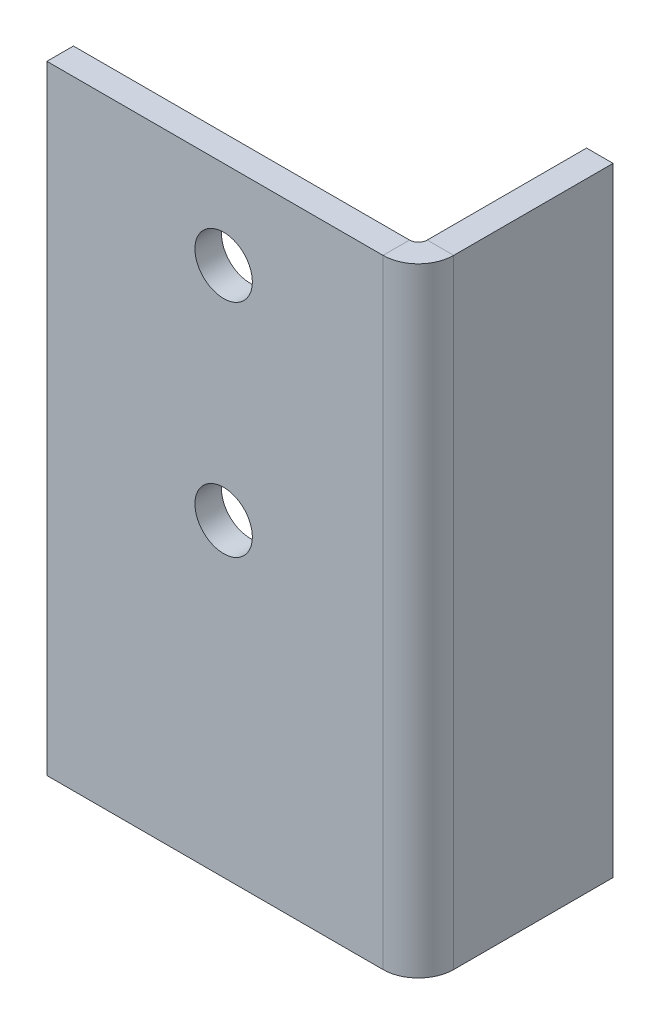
ISO-10303-21;
HEADER;
FILE_DESCRIPTION(('STEP AP214'),'2;1');
FILE_NAME('part.step','',(''),(''),'','','');
FILE_SCHEMA(('AUTOMOTIVE_DESIGN { 1 0 10303 214 1 1 1 1 }'));
ENDSEC;
DATA;
#1=APPLICATION_CONTEXT('core data for automotive mechanical design processes');
#2=APPLICATION_PROTOCOL_DEFINITION('international standard','automotive_design',2000,#1);
#3=PRODUCT_CONTEXT('',#1,'mechanical');
#4=PRODUCT('Part','Part','',(#3));
#5=PRODUCT_RELATED_PRODUCT_CATEGORY('part','',(#4));
#6=PRODUCT_DEFINITION_FORMATION('','',#4);
#7=PRODUCT_DEFINITION_CONTEXT('part definition',#1,'design');
#8=PRODUCT_DEFINITION('design','',#6,#7);
#9=PRODUCT_DEFINITION_SHAPE('','',#8);
#10=(LENGTH_UNIT() NAMED_UNIT(*) SI_UNIT(.MILLI.,.METRE.));
#11=(NAMED_UNIT(*) PLANE_ANGLE_UNIT() SI_UNIT($,.RADIAN.));
#12=(NAMED_UNIT(*) SI_UNIT($,.STERADIAN.) SOLID_ANGLE_UNIT());
#13=UNCERTAINTY_MEASURE_WITH_UNIT(LENGTH_MEASURE(1.E-05),#10,'distance_accuracy_value','');
#14=(GEOMETRIC_REPRESENTATION_CONTEXT(3) GLOBAL_UNCERTAINTY_ASSIGNED_CONTEXT((#13)) GLOBAL_UNIT_ASSIGNED_CONTEXT((#10,
#11,#12)) REPRESENTATION_CONTEXT('',''));
#15=CARTESIAN_POINT('',(0.,0.,0.));
#16=DIRECTION('',(0.,0.,1.));
#17=DIRECTION('',(1.,0.,0.));
#18=AXIS2_PLACEMENT_3D('',#15,#16,#17);
#19=CARTESIAN_POINT('',(-35.926990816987,140.,81.9269908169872));
#20=DIRECTION('',(0.,-1.,0.));
#21=DIRECTION('',(-1.,0.,0.));
#22=AXIS2_PLACEMENT_3D('',#19,#20,#21);
#23=PLANE('',#22);
#24=DIRECTION('',(0.,0.,1.));
#25=VECTOR('',#24,1.);
#26=CARTESIAN_POINT('',(-41.926990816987,140.,81.9269908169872));
#27=LINE('',#26,#25);
#28=CARTESIAN_POINT('',(-41.9269908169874,140.,-38.0730091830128));
#29=VERTEX_POINT('',#28);
#30=CARTESIAN_POINT('',(-41.9269908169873,140.,-2.00000000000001));
#31=VERTEX_POINT('',#30);
#32=EDGE_CURVE('E93',#29,#31,#27,.T.);
#33=ORIENTED_EDGE('',*,*,#32,.T.);
#34=DIRECTION('',(1.,0.,0.));
#35=VECTOR('',#34,1.);
#36=CARTESIAN_POINT('',(-35.9269908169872,140.,-2.00000000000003));
#37=LINE('',#36,#35);
#38=CARTESIAN_POINT('',(-35.9269908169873,140.,-2.00000000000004));
#39=VERTEX_POINT('',#38);
#40=EDGE_CURVE('E108',#31,#39,#37,.T.);
#41=ORIENTED_EDGE('',*,*,#40,.T.);
#42=DIRECTION('',(0.,0.,1.));
#43=VECTOR('',#42,1.);
#44=CARTESIAN_POINT('',(-35.926990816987,140.,81.9269908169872));
#45=LINE('',#44,#43);
#46=CARTESIAN_POINT('',(-35.9269908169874,140.,-38.0730091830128));
#47=VERTEX_POINT('',#46);
#48=EDGE_CURVE('E49',#47,#39,#45,.T.);
#49=ORIENTED_EDGE('',*,*,#48,.F.);
#50=DIRECTION('',(-1.,0.,0.));
#51=VECTOR('',#50,1.);
#52=CARTESIAN_POINT('',(-35.9269908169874,140.,-38.0730091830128));
#53=LINE('',#52,#51);
#54=EDGE_CURVE('E86',#47,#29,#53,.T.);
#55=ORIENTED_EDGE('',*,*,#54,.T.);
#56=EDGE_LOOP('',(#33,#41,#49,#55));
#57=FACE_BOUND('',#56,.T.);
#58=ADVANCED_FACE('F45',(#57),#23,.F.);
#59=CARTESIAN_POINT('',(-35.926990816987,0.,81.9269908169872));
#60=DIRECTION('',(0.,1.,0.));
#61=DIRECTION('',(1.,0.,0.));
#62=AXIS2_PLACEMENT_3D('',#59,#60,#61);
#63=PLANE('',#62);
#64=DIRECTION('',(0.,0.,-1.));
#65=VECTOR('',#64,1.);
#66=CARTESIAN_POINT('',(-35.926990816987,0.,81.9269908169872));
#67=LINE('',#66,#65);
#68=CARTESIAN_POINT('',(-35.9269908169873,0.,-2.00000000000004));
#69=VERTEX_POINT('',#68);
#70=CARTESIAN_POINT('',(-35.9269908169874,0.,-38.0730091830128));
#71=VERTEX_POINT('',#70);
#72=EDGE_CURVE('E102',#69,#71,#67,.T.);
#73=ORIENTED_EDGE('',*,*,#72,.F.);
#74=DIRECTION('',(-1.,0.,0.));
#75=VECTOR('',#74,1.);
#76=CARTESIAN_POINT('',(-35.9269908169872,0.,-2.00000000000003));
#77=LINE('',#76,#75);
#78=CARTESIAN_POINT('',(-41.9269908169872,0.,-2.00000000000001));
#79=VERTEX_POINT('',#78);
#80=EDGE_CURVE('E12',#69,#79,#77,.T.);
#81=ORIENTED_EDGE('',*,*,#80,.T.);
#82=DIRECTION('',(0.,0.,-1.));
#83=VECTOR('',#82,1.);
#84=CARTESIAN_POINT('',(-41.926990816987,0.,81.9269908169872));
#85=LINE('',#84,#83);
#86=CARTESIAN_POINT('',(-41.9269908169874,0.,-38.0730091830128));
#87=VERTEX_POINT('',#86);
#88=EDGE_CURVE('E94',#79,#87,#85,.T.);
#89=ORIENTED_EDGE('',*,*,#88,.T.);
#90=DIRECTION('',(-1.,0.,0.));
#91=VECTOR('',#90,1.);
#92=CARTESIAN_POINT('',(-35.9269908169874,0.,-38.0730091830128));
#93=LINE('',#92,#91);
#94=EDGE_CURVE('E89',#71,#87,#93,.T.);
#95=ORIENTED_EDGE('',*,*,#94,.F.);
#96=EDGE_LOOP('',(#73,#81,#89,#95));
#97=FACE_BOUND('',#96,.T.);
#98=ADVANCED_FACE('F47',(#97),#63,.F.);
#99=CARTESIAN_POINT('',(-35.926990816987,140.,81.9269908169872));
#100=DIRECTION('',(-1.,0.,0.));
#101=DIRECTION('',(0.,0.,1.));
#102=AXIS2_PLACEMENT_3D('',#99,#100,#101);
#103=PLANE('',#102);
#104=ORIENTED_EDGE('',*,*,#48,.T.);
#105=DIRECTION('',(0.,-1.,0.));
#106=VECTOR('',#105,1.);
#107=CARTESIAN_POINT('',(-35.9269908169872,140.,-2.00000000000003));
#108=LINE('',#107,#106);
#109=EDGE_CURVE('E110',#39,#69,#108,.T.);
#110=ORIENTED_EDGE('',*,*,#109,.T.);
#111=ORIENTED_EDGE('',*,*,#72,.T.);
#112=DIRECTION('',(0.,1.,0.));
#113=VECTOR('',#112,1.);
#114=CARTESIAN_POINT('',(-35.9269908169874,0.,-38.0730091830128));
#115=LINE('',#114,#113);
#116=EDGE_CURVE('E70',#71,#47,#115,.T.);
#117=ORIENTED_EDGE('',*,*,#116,.T.);
#118=EDGE_LOOP('',(#104,#110,#111,#117));
#119=FACE_BOUND('',#118,.T.);
#120=ADVANCED_FACE('F242',(#119),#103,.F.);
#121=CARTESIAN_POINT('',(-41.926990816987,140.,81.9269908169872));
#122=DIRECTION('',(-1.,0.,0.));
#123=DIRECTION('',(0.,0.,1.));
#124=AXIS2_PLACEMENT_3D('',#121,#122,#123);
#125=PLANE('',#124);
#126=DIRECTION('',(0.,-1.,0.));
#127=VECTOR('',#126,1.);
#128=CARTESIAN_POINT('',(-41.9269908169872,140.,-2.00000000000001));
#129=LINE('',#128,#127);
#130=EDGE_CURVE('E54',#31,#79,#129,.T.);
#131=ORIENTED_EDGE('',*,*,#130,.F.);
#132=ORIENTED_EDGE('',*,*,#32,.F.);
#133=DIRECTION('',(0.,1.,0.));
#134=VECTOR('',#133,1.);
#135=CARTESIAN_POINT('',(-41.9269908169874,0.,-38.0730091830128));
#136=LINE('',#135,#134);
#137=EDGE_CURVE('E83',#87,#29,#136,.T.);
#138=ORIENTED_EDGE('',*,*,#137,.F.);
#139=ORIENTED_EDGE('',*,*,#88,.F.);
#140=EDGE_LOOP('',(#131,#132,#138,#139));
#141=FACE_BOUND('',#140,.T.);
#142=ADVANCED_FACE('F101',(#141),#125,.T.);
#143=CARTESIAN_POINT('',(-35.9269908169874,0.,-38.0730091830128));
#144=DIRECTION('',(0.,0.,1.));
#145=DIRECTION('',(1.,0.,0.));
#146=AXIS2_PLACEMENT_3D('',#143,#144,#145);
#147=PLANE('',#146);
#148=ORIENTED_EDGE('',*,*,#137,.T.);
#149=ORIENTED_EDGE('',*,*,#54,.F.);
#150=ORIENTED_EDGE('',*,*,#116,.F.);
#151=ORIENTED_EDGE('',*,*,#94,.T.);
#152=EDGE_LOOP('',(#148,#149,#150,#151));
#153=FACE_BOUND('',#152,.T.);
#154=ADVANCED_FACE('F85',(#153),#147,.F.);
#155=CARTESIAN_POINT('',(-80.,120.,6.));
#156=DIRECTION('',(0.,0.,-1.));
#157=DIRECTION('',(-1.,0.,0.));
#158=AXIS2_PLACEMENT_3D('',#155,#156,#157);
#159=CYLINDRICAL_SURFACE('',#158,6.5);
#160=CARTESIAN_POINT('',(-80.,120.,6.));
#161=DIRECTION('',(0.,0.,1.));
#162=DIRECTION('',(1.,0.,0.));
#163=AXIS2_PLACEMENT_3D('',#160,#161,#162);
#164=CIRCLE('',#163,6.5);
#165=CARTESIAN_POINT('',(-73.5,120.,6.));
#166=VERTEX_POINT('',#165);
#167=EDGE_CURVE('E125',#166,#166,#164,.T.);
#168=ORIENTED_EDGE('',*,*,#167,.T.);
#169=EDGE_LOOP('',(#168));
#170=FACE_BOUND('',#169,.T.);
#171=CARTESIAN_POINT('',(-80.,120.,0.));
#172=DIRECTION('',(0.,0.,1.));
#173=DIRECTION('',(1.,0.,0.));
#174=AXIS2_PLACEMENT_3D('',#171,#172,#173);
#175=CIRCLE('',#174,6.5);
#176=CARTESIAN_POINT('',(-73.5,120.,0.));
#177=VERTEX_POINT('',#176);
#178=EDGE_CURVE('E152',#177,#177,#175,.T.);
#179=ORIENTED_EDGE('',*,*,#178,.F.);
#180=EDGE_LOOP('',(#179));
#181=FACE_BOUND('',#180,.T.);
#182=ADVANCED_FACE('F234',(#170,#181),#159,.F.);
#183=CARTESIAN_POINT('',(-80.,70.,6.));
#184=DIRECTION('',(0.,0.,-1.));
#185=DIRECTION('',(-1.,0.,0.));
#186=AXIS2_PLACEMENT_3D('',#183,#184,#185);
#187=CYLINDRICAL_SURFACE('',#186,6.5);
#188=CARTESIAN_POINT('',(-80.,70.,6.));
#189=DIRECTION('',(0.,0.,1.));
#190=DIRECTION('',(1.,0.,0.));
#191=AXIS2_PLACEMENT_3D('',#188,#189,#190);
#192=CIRCLE('',#191,6.5);
#193=CARTESIAN_POINT('',(-73.5,70.,6.));
#194=VERTEX_POINT('',#193);
#195=EDGE_CURVE('E128',#194,#194,#192,.T.);
#196=ORIENTED_EDGE('',*,*,#195,.T.);
#197=EDGE_LOOP('',(#196));
#198=FACE_BOUND('',#197,.T.);
#199=CARTESIAN_POINT('',(-80.,70.,0.));
#200=DIRECTION('',(0.,0.,1.));
#201=DIRECTION('',(1.,0.,0.));
#202=AXIS2_PLACEMENT_3D('',#199,#200,#201);
#203=CIRCLE('',#202,6.5);
#204=CARTESIAN_POINT('',(-73.5,70.,0.));
#205=VERTEX_POINT('',#204);
#206=EDGE_CURVE('E149',#205,#205,#203,.T.);
#207=ORIENTED_EDGE('',*,*,#206,.F.);
#208=EDGE_LOOP('',(#207));
#209=FACE_BOUND('',#208,.T.);
#210=ADVANCED_FACE('F227',(#198,#209),#187,.F.);
#211=CARTESIAN_POINT('',(-120.,0.,6.));
#212=DIRECTION('',(1.,0.,0.));
#213=DIRECTION('',(0.,0.,-1.));
#214=AXIS2_PLACEMENT_3D('',#211,#212,#213);
#215=PLANE('',#214);
#216=DIRECTION('',(0.,-1.,0.));
#217=VECTOR('',#216,1.);
#218=CARTESIAN_POINT('',(-120.,0.,0.));
#219=LINE('',#218,#217);
#220=CARTESIAN_POINT('',(-120.,140.,0.));
#221=VERTEX_POINT('',#220);
#222=CARTESIAN_POINT('',(-120.,0.,0.));
#223=VERTEX_POINT('',#222);
#224=EDGE_CURVE('E131',#221,#223,#219,.T.);
#225=ORIENTED_EDGE('',*,*,#224,.T.);
#226=DIRECTION('',(0.,0.,-1.));
#227=VECTOR('',#226,1.);
#228=CARTESIAN_POINT('',(-120.,0.,6.));
#229=LINE('',#228,#227);
#230=CARTESIAN_POINT('',(-120.,0.,6.));
#231=VERTEX_POINT('',#230);
#232=EDGE_CURVE('E158',#231,#223,#229,.T.);
#233=ORIENTED_EDGE('',*,*,#232,.F.);
#234=DIRECTION('',(0.,-1.,0.));
#235=VECTOR('',#234,1.);
#236=CARTESIAN_POINT('',(-120.,0.,6.));
#237=LINE('',#236,#235);
#238=CARTESIAN_POINT('',(-120.,140.,6.));
#239=VERTEX_POINT('',#238);
#240=EDGE_CURVE('E140',#239,#231,#237,.T.);
#241=ORIENTED_EDGE('',*,*,#240,.F.);
#242=DIRECTION('',(0.,0.,-1.));
#243=VECTOR('',#242,1.);
#244=CARTESIAN_POINT('',(-120.,140.,6.));
#245=LINE('',#244,#243);
#246=EDGE_CURVE('E134',#239,#221,#245,.T.);
#247=ORIENTED_EDGE('',*,*,#246,.T.);
#248=EDGE_LOOP('',(#225,#233,#241,#247));
#249=FACE_BOUND('',#248,.T.);
#250=ADVANCED_FACE('F225',(#249),#215,.F.);
#251=CARTESIAN_POINT('',(-120.,140.,6.));
#252=DIRECTION('',(0.,0.,-1.));
#253=DIRECTION('',(-1.,0.,0.));
#254=AXIS2_PLACEMENT_3D('',#251,#252,#253);
#255=PLANE('',#254);
#256=DIRECTION('',(0.,-1.,0.));
#257=VECTOR('',#256,1.);
#258=CARTESIAN_POINT('',(-43.9269908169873,140.,6.));
#259=LINE('',#258,#257);
#260=CARTESIAN_POINT('',(-43.9269908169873,140.,6.));
#261=VERTEX_POINT('',#260);
#262=CARTESIAN_POINT('',(-43.9269908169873,0.,6.));
#263=VERTEX_POINT('',#262);
#264=EDGE_CURVE('E115',#261,#263,#259,.T.);
#265=ORIENTED_EDGE('',*,*,#264,.F.);
#266=DIRECTION('',(-1.,0.,0.));
#267=VECTOR('',#266,1.);
#268=CARTESIAN_POINT('',(-120.,140.,6.));
#269=LINE('',#268,#267);
#270=EDGE_CURVE('E137',#261,#239,#269,.T.);
#271=ORIENTED_EDGE('',*,*,#270,.T.);
#272=ORIENTED_EDGE('',*,*,#240,.T.);
#273=DIRECTION('',(1.,0.,0.));
#274=VECTOR('',#273,1.);
#275=CARTESIAN_POINT('',(-120.,0.,6.));
#276=LINE('',#275,#274);
#277=EDGE_CURVE('E143',#231,#263,#276,.T.);
#278=ORIENTED_EDGE('',*,*,#277,.T.);
#279=EDGE_LOOP('',(#265,#271,#272,#278));
#280=FACE_BOUND('',#279,.T.);
#281=ORIENTED_EDGE('',*,*,#195,.F.);
#282=EDGE_LOOP('',(#281));
#283=FACE_BOUND('',#282,.T.);
#284=ORIENTED_EDGE('',*,*,#167,.F.);
#285=EDGE_LOOP('',(#284));
#286=FACE_BOUND('',#285,.T.);
#287=ADVANCED_FACE('F208',(#280,#283,#286),#255,.F.);
#288=CARTESIAN_POINT('',(-120.,140.,6.));
#289=DIRECTION('',(0.,-1.,0.));
#290=DIRECTION('',(0.,0.,-1.));
#291=AXIS2_PLACEMENT_3D('',#288,#289,#290);
#292=PLANE('',#291);
#293=DIRECTION('',(0.,0.,1.));
#294=VECTOR('',#293,1.);
#295=CARTESIAN_POINT('',(-43.9269908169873,140.,6.));
#296=LINE('',#295,#294);
#297=CARTESIAN_POINT('',(-43.9269908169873,140.,0.));
#298=VERTEX_POINT('',#297);
#299=EDGE_CURVE('E122',#298,#261,#296,.T.);
#300=ORIENTED_EDGE('',*,*,#299,.F.);
#301=DIRECTION('',(-1.,0.,0.));
#302=VECTOR('',#301,1.);
#303=CARTESIAN_POINT('',(-120.,140.,0.));
#304=LINE('',#303,#302);
#305=EDGE_CURVE('E146',#298,#221,#304,.T.);
#306=ORIENTED_EDGE('',*,*,#305,.T.);
#307=ORIENTED_EDGE('',*,*,#246,.F.);
#308=ORIENTED_EDGE('',*,*,#270,.F.);
#309=EDGE_LOOP('',(#300,#306,#307,#308));
#310=FACE_BOUND('',#309,.T.);
#311=ADVANCED_FACE('F223',(#310),#292,.F.);
#312=CARTESIAN_POINT('',(-120.,140.,0.));
#313=DIRECTION('',(0.,0.,-1.));
#314=DIRECTION('',(-1.,0.,0.));
#315=AXIS2_PLACEMENT_3D('',#312,#313,#314);
#316=PLANE('',#315);
#317=ORIENTED_EDGE('',*,*,#206,.T.);
#318=EDGE_LOOP('',(#317));
#319=FACE_BOUND('',#318,.T.);
#320=ORIENTED_EDGE('',*,*,#178,.T.);
#321=EDGE_LOOP('',(#320));
#322=FACE_BOUND('',#321,.T.);
#323=ORIENTED_EDGE('',*,*,#305,.F.);
#324=DIRECTION('',(0.,-1.,0.));
#325=VECTOR('',#324,1.);
#326=CARTESIAN_POINT('',(-43.9269908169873,140.,0.));
#327=LINE('',#326,#325);
#328=CARTESIAN_POINT('',(-43.9269908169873,0.,0.));
#329=VERTEX_POINT('',#328);
#330=EDGE_CURVE('E155',#298,#329,#327,.T.);
#331=ORIENTED_EDGE('',*,*,#330,.T.);
#332=DIRECTION('',(1.,0.,0.));
#333=VECTOR('',#332,1.);
#334=CARTESIAN_POINT('',(-120.,0.,0.));
#335=LINE('',#334,#333);
#336=EDGE_CURVE('E105',#223,#329,#335,.T.);
#337=ORIENTED_EDGE('',*,*,#336,.F.);
#338=ORIENTED_EDGE('',*,*,#224,.F.);
#339=EDGE_LOOP('',(#323,#331,#337,#338));
#340=FACE_BOUND('',#339,.T.);
#341=ADVANCED_FACE('F219',(#319,#322,#340),#316,.T.);
#342=CARTESIAN_POINT('',(-120.,0.,6.));
#343=DIRECTION('',(0.,1.,0.));
#344=DIRECTION('',(0.,0.,1.));
#345=AXIS2_PLACEMENT_3D('',#342,#343,#344);
#346=PLANE('',#345);
#347=DIRECTION('',(0.,0.,-1.));
#348=VECTOR('',#347,1.);
#349=CARTESIAN_POINT('',(-43.9269908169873,0.,6.));
#350=LINE('',#349,#348);
#351=EDGE_CURVE('E118',#263,#329,#350,.T.);
#352=ORIENTED_EDGE('',*,*,#351,.F.);
#353=ORIENTED_EDGE('',*,*,#277,.F.);
#354=ORIENTED_EDGE('',*,*,#232,.T.);
#355=ORIENTED_EDGE('',*,*,#336,.T.);
#356=EDGE_LOOP('',(#352,#353,#354,#355));
#357=FACE_BOUND('',#356,.T.);
#358=ADVANCED_FACE('F213',(#357),#346,.F.);
#359=CARTESIAN_POINT('',(-43.9269908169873,140.,-2.));
#360=DIRECTION('',(0.,1.,0.));
#361=DIRECTION('',(0.,0.,1.));
#362=AXIS2_PLACEMENT_3D('',#359,#360,#361);
#363=PLANE('',#362);
#364=ORIENTED_EDGE('',*,*,#40,.F.);
#365=CARTESIAN_POINT('',(-43.9269908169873,140.,-2.));
#366=DIRECTION('',(0.,1.,0.));
#367=DIRECTION('',(0.,0.,1.));
#368=AXIS2_PLACEMENT_3D('',#365,#366,#367);
#369=CIRCLE('',#368,2.);
#370=EDGE_CURVE('E163',#31,#298,#369,.F.);
#371=ORIENTED_EDGE('',*,*,#370,.T.);
#372=ORIENTED_EDGE('',*,*,#299,.T.);
#373=CARTESIAN_POINT('',(-43.9269908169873,140.,-2.));
#374=DIRECTION('',(0.,-1.,0.));
#375=DIRECTION('',(0.,0.,-1.));
#376=AXIS2_PLACEMENT_3D('',#373,#374,#375);
#377=CIRCLE('',#376,8.);
#378=EDGE_CURVE('E168',#39,#261,#377,.T.);
#379=ORIENTED_EDGE('',*,*,#378,.F.);
#380=EDGE_LOOP('',(#364,#371,#372,#379));
#381=FACE_BOUND('',#380,.T.);
#382=ADVANCED_FACE('F186',(#381),#363,.T.);
#383=CARTESIAN_POINT('',(-43.9269908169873,0.,-2.));
#384=DIRECTION('',(0.,-1.,0.));
#385=DIRECTION('',(0.,0.,-1.));
#386=AXIS2_PLACEMENT_3D('',#383,#384,#385);
#387=PLANE('',#386);
#388=ORIENTED_EDGE('',*,*,#351,.T.);
#389=CARTESIAN_POINT('',(-43.9269908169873,0.,-2.));
#390=DIRECTION('',(0.,1.,0.));
#391=DIRECTION('',(0.,0.,1.));
#392=AXIS2_PLACEMENT_3D('',#389,#390,#391);
#393=CIRCLE('',#392,2.);
#394=EDGE_CURVE('E166',#329,#79,#393,.T.);
#395=ORIENTED_EDGE('',*,*,#394,.T.);
#396=ORIENTED_EDGE('',*,*,#80,.F.);
#397=CARTESIAN_POINT('',(-43.9269908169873,0.,-2.));
#398=DIRECTION('',(0.,1.,0.));
#399=DIRECTION('',(0.,0.,1.));
#400=AXIS2_PLACEMENT_3D('',#397,#398,#399);
#401=CIRCLE('',#400,8.);
#402=EDGE_CURVE('E119',#263,#69,#401,.T.);
#403=ORIENTED_EDGE('',*,*,#402,.F.);
#404=EDGE_LOOP('',(#388,#395,#396,#403));
#405=FACE_BOUND('',#404,.T.);
#406=ADVANCED_FACE('F215',(#405),#387,.T.);
#407=CARTESIAN_POINT('',(-43.9269908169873,-70.3484414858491,-2.));
#408=DIRECTION('',(0.,1.,0.));
#409=DIRECTION('',(0.,0.,1.));
#410=AXIS2_PLACEMENT_3D('',#407,#408,#409);
#411=CYLINDRICAL_SURFACE('',#410,8.);
#412=ORIENTED_EDGE('',*,*,#402,.T.);
#413=ORIENTED_EDGE('',*,*,#109,.F.);
#414=ORIENTED_EDGE('',*,*,#378,.T.);
#415=ORIENTED_EDGE('',*,*,#264,.T.);
#416=EDGE_LOOP('',(#412,#413,#414,#415));
#417=FACE_BOUND('',#416,.T.);
#418=ADVANCED_FACE('F176',(#417),#411,.T.);
#419=CARTESIAN_POINT('',(-43.9269908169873,-70.3484414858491,-2.));
#420=DIRECTION('',(0.,1.,0.));
#421=DIRECTION('',(0.,0.,1.));
#422=AXIS2_PLACEMENT_3D('',#419,#420,#421);
#423=CYLINDRICAL_SURFACE('',#422,2.);
#424=ORIENTED_EDGE('',*,*,#394,.F.);
#425=ORIENTED_EDGE('',*,*,#330,.F.);
#426=ORIENTED_EDGE('',*,*,#370,.F.);
#427=ORIENTED_EDGE('',*,*,#130,.T.);
#428=EDGE_LOOP('',(#424,#425,#426,#427));
#429=FACE_BOUND('',#428,.T.);
#430=ADVANCED_FACE('F217',(#429),#423,.F.);
#431=CLOSED_SHELL('',(#58,#98,#120,#142,#154,#182,#210,#250,#287,#311,#341,#358,#382,#406,#418,#430));
#432=MANIFOLD_SOLID_BREP('B2',#431);
#433=ADVANCED_BREP_SHAPE_REPRESENTATION('',(#18,#432),#14);
#434=SHAPE_DEFINITION_REPRESENTATION(#9,#433);
ENDSEC;
END-ISO-10303-21;
